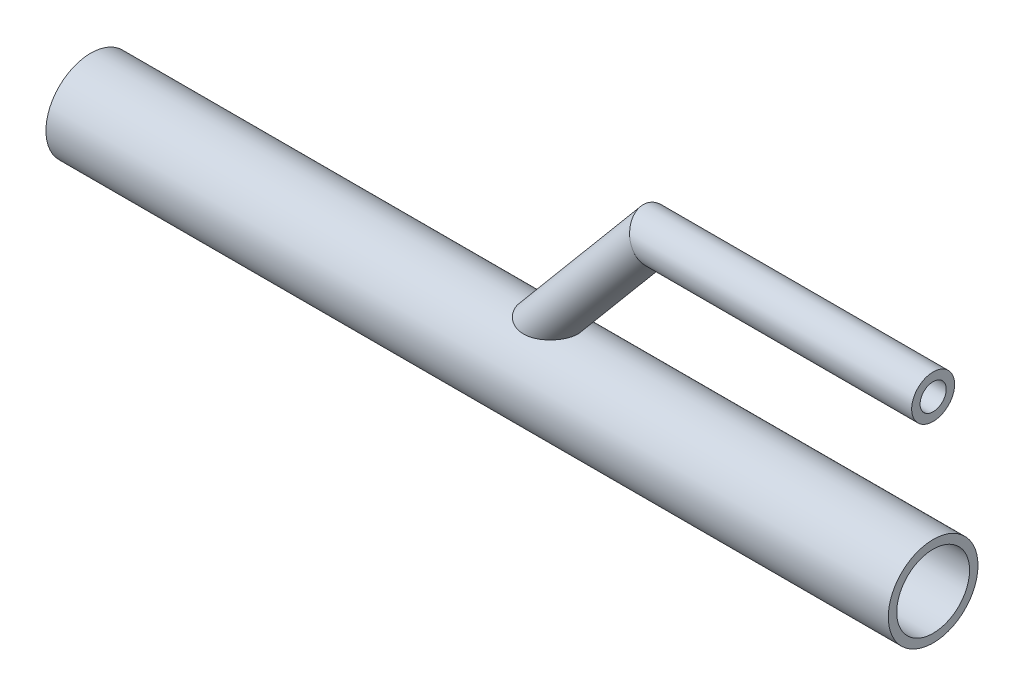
ISO-10303-21;
HEADER;
FILE_DESCRIPTION(('STEP AP214'),'2;1');
FILE_NAME('part.step','',(''),(''),'','','');
FILE_SCHEMA(('AUTOMOTIVE_DESIGN { 1 0 10303 214 1 1 1 1 }'));
ENDSEC;
DATA;
#1=APPLICATION_CONTEXT('core data for automotive mechanical design processes');
#2=APPLICATION_PROTOCOL_DEFINITION('international standard','automotive_design',2000,#1);
#3=PRODUCT_CONTEXT('',#1,'mechanical');
#4=PRODUCT('Part','Part','',(#3));
#5=PRODUCT_RELATED_PRODUCT_CATEGORY('part','',(#4));
#6=PRODUCT_DEFINITION_FORMATION('','',#4);
#7=PRODUCT_DEFINITION_CONTEXT('part definition',#1,'design');
#8=PRODUCT_DEFINITION('design','',#6,#7);
#9=PRODUCT_DEFINITION_SHAPE('','',#8);
#10=(LENGTH_UNIT() NAMED_UNIT(*) SI_UNIT(.MILLI.,.METRE.));
#11=(NAMED_UNIT(*) PLANE_ANGLE_UNIT() SI_UNIT($,.RADIAN.));
#12=(NAMED_UNIT(*) SI_UNIT($,.STERADIAN.) SOLID_ANGLE_UNIT());
#13=UNCERTAINTY_MEASURE_WITH_UNIT(LENGTH_MEASURE(1.E-05),#10,'distance_accuracy_value','');
#14=(GEOMETRIC_REPRESENTATION_CONTEXT(3) GLOBAL_UNCERTAINTY_ASSIGNED_CONTEXT((#13)) GLOBAL_UNIT_ASSIGNED_CONTEXT((#10,
#11,#12)) REPRESENTATION_CONTEXT('',''));
#15=CARTESIAN_POINT('',(0.,0.,0.));
#16=DIRECTION('',(0.,0.,1.));
#17=DIRECTION('',(1.,0.,0.));
#18=AXIS2_PLACEMENT_3D('',#15,#16,#17);
#19=CARTESIAN_POINT('',(133.563985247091,40.0000000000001,0.));
#20=DIRECTION('',(-0.642787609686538,-0.766044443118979,0.));
#21=DIRECTION('',(0.766044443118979,-0.642787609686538,0.));
#22=AXIS2_PLACEMENT_3D('',#19,#20,#21);
#23=CYLINDRICAL_SURFACE('',#22,3.09999999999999);
#24=CARTESIAN_POINT('',(133.563985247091,40.0000000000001,0.));
#25=DIRECTION('',(0.90630778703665,0.4226182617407,0.));
#26=DIRECTION('',(0.4226182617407,-0.90630778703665,0.));
#27=AXIS2_PLACEMENT_3D('',#24,#25,#26);
#28=ELLIPSE('',#27,3.42047154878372,3.09999999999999);
#29=CARTESIAN_POINT('',(135.009538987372,36.9000000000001,0.));
#30=VERTEX_POINT('',#29);
#31=EDGE_CURVE('E67',#30,#30,#28,.T.);
#32=ORIENTED_EDGE('',*,*,#31,.T.);
#33=EDGE_LOOP('',(#32));
#34=FACE_BOUND('',#33,.T.);
#35=CARTESIAN_POINT('',(112.983173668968,10.65,0.));
#36=CARTESIAN_POINT('',(112.983173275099,10.6499998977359,0.065892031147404));
#37=CARTESIAN_POINT('',(112.979909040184,10.6493862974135,0.131793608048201));
#38=CARTESIAN_POINT('',(112.966946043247,10.6469552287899,0.262969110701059));
#39=CARTESIAN_POINT('',(112.957243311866,10.6451370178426,0.328242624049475));
#40=CARTESIAN_POINT('',(112.93164980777,10.6403596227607,0.457653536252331));
#41=CARTESIAN_POINT('',(112.915746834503,10.6373981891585,0.521788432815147));
#42=CARTESIAN_POINT('',(112.878173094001,10.6304388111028,0.648301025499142));
#43=CARTESIAN_POINT('',(112.856499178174,10.626440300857,0.710677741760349));
#44=CARTESIAN_POINT('',(112.784092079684,10.6131727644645,0.893195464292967));
#45=CARTESIAN_POINT('',(112.725653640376,10.6025706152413,1.01024498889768));
#46=CARTESIAN_POINT('',(112.592355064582,10.5788659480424,1.23402442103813));
#47=CARTESIAN_POINT('',(112.517491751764,10.565762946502,1.34075232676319));
#48=CARTESIAN_POINT('',(112.310212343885,10.5303863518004,1.59960426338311));
#49=CARTESIAN_POINT('',(112.168802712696,10.5070356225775,1.74436936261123));
#50=CARTESIAN_POINT('',(111.865101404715,10.4594758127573,2.01001455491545));
#51=CARTESIAN_POINT('',(111.702751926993,10.4352644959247,2.13082609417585));
#52=CARTESIAN_POINT('',(111.410937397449,10.3946361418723,2.31959657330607));
#53=CARTESIAN_POINT('',(111.284904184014,10.377926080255,2.39290505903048));
#54=CARTESIAN_POINT('',(111.026841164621,10.3457215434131,2.5285204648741));
#55=CARTESIAN_POINT('',(110.894808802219,10.3302275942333,2.59082263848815));
#56=CARTESIAN_POINT('',(110.62591994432,10.3009735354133,2.70479252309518));
#57=CARTESIAN_POINT('',(110.489059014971,10.2872150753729,2.75645014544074));
#58=CARTESIAN_POINT('',(110.211628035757,10.2619156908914,2.84919207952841));
#59=CARTESIAN_POINT('',(110.071058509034,10.2503744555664,2.89027787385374));
#60=CARTESIAN_POINT('',(109.783870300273,10.2297065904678,2.96260868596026));
#61=CARTESIAN_POINT('',(109.63718663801,10.2206397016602,2.99361320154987));
#62=CARTESIAN_POINT('',(109.341676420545,10.2056886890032,3.04419339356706));
#63=CARTESIAN_POINT('',(109.192849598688,10.1998049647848,3.06376763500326));
#64=CARTESIAN_POINT('',(108.894189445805,10.1916073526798,3.09093005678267));
#65=CARTESIAN_POINT('',(108.744357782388,10.1892885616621,3.09853470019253));
#66=CARTESIAN_POINT('',(108.444634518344,10.1885119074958,3.10108206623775));
#67=CARTESIAN_POINT('',(108.294742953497,10.1900527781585,3.09602894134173));
#68=CARTESIAN_POINT('',(107.919719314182,10.1990516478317,3.06631998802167));
#69=CARTESIAN_POINT('',(107.695236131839,10.2091285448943,3.03297463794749));
#70=CARTESIAN_POINT('',(107.254873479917,10.238605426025,2.93193737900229));
#71=CARTESIAN_POINT('',(107.038982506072,10.2579924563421,2.8642931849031));
#72=CARTESIAN_POINT('',(106.657876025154,10.3007316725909,2.70608521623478));
#73=CARTESIAN_POINT('',(106.490204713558,10.322887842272,2.62120567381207));
#74=CARTESIAN_POINT('',(106.251341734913,10.3587410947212,2.4741669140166));
#75=CARTESIAN_POINT('',(106.173797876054,10.3711344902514,2.42184104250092));
#76=CARTESIAN_POINT('',(106.023626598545,10.3964631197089,2.31069416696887));
#77=CARTESIAN_POINT('',(105.950997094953,10.4093981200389,2.25187594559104));
#78=CARTESIAN_POINT('',(105.810912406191,10.4355244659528,2.1275306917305));
#79=CARTESIAN_POINT('',(105.743493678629,10.4487169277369,2.06196277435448));
#80=CARTESIAN_POINT('',(105.615092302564,10.4748504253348,1.92480649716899));
#81=CARTESIAN_POINT('',(105.55410664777,10.487791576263,1.85322097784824));
#82=CARTESIAN_POINT('',(105.439196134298,10.512991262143,1.70446368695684));
#83=CARTESIAN_POINT('',(105.385271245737,10.5252497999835,1.62729193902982));
#84=CARTESIAN_POINT('',(105.285087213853,10.5486475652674,1.46800285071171));
#85=CARTESIAN_POINT('',(105.238827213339,10.5597869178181,1.38588606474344));
#86=CARTESIAN_POINT('',(105.121351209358,10.5886816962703,1.15116160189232));
#87=CARTESIAN_POINT('',(105.059010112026,10.6047757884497,0.99377051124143));
#88=CARTESIAN_POINT('',(104.962582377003,10.6301334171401,0.670149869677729));
#89=CARTESIAN_POINT('',(104.928485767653,10.6393993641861,0.503923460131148));
#90=CARTESIAN_POINT('',(104.890600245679,10.6497234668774,0.176758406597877));
#91=CARTESIAN_POINT('',(104.885299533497,10.6511909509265,0.0160070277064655));
#92=CARTESIAN_POINT('',(104.901103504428,10.646861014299,-0.304073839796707));
#93=CARTESIAN_POINT('',(104.9222042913,10.6410646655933,-0.463403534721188));
#94=CARTESIAN_POINT('',(104.98982251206,10.6229396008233,-0.774386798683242));
#95=CARTESIAN_POINT('',(105.036066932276,10.6106810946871,-0.926104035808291));
#96=CARTESIAN_POINT('',(105.152423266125,10.580975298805,-1.21951925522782));
#97=CARTESIAN_POINT('',(105.222534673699,10.5635281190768,-1.36121744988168));
#98=CARTESIAN_POINT('',(105.385798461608,10.5249407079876,-1.63319203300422));
#99=CARTESIAN_POINT('',(105.479299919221,10.5037460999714,-1.76325064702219));
#100=CARTESIAN_POINT('',(105.685798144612,10.4600039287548,-2.00652186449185));
#101=CARTESIAN_POINT('',(105.798797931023,10.4374561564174,-2.11973185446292));
#102=CARTESIAN_POINT('',(106.047499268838,10.3918729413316,-2.33325447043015));
#103=CARTESIAN_POINT('',(106.184107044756,10.368878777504,-2.43251663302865));
#104=CARTESIAN_POINT('',(106.470921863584,10.3257376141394,-2.60959130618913));
#105=CARTESIAN_POINT('',(106.621133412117,10.3055915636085,-2.68739667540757));
#106=CARTESIAN_POINT('',(106.949646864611,10.2674198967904,-2.82996464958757));
#107=CARTESIAN_POINT('',(107.129161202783,10.249934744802,-2.89206038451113));
#108=CARTESIAN_POINT('',(107.495447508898,10.2213714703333,-2.9914438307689));
#109=CARTESIAN_POINT('',(107.682225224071,10.2102985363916,-3.02871145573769));
#110=CARTESIAN_POINT('',(108.01022515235,10.1968198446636,-3.07371428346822));
#111=CARTESIAN_POINT('',(108.150722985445,10.1929124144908,-3.08659723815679));
#112=CARTESIAN_POINT('',(108.43240775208,10.1886499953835,-3.10064073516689));
#113=CARTESIAN_POINT('',(108.573594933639,10.1882963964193,-3.10179669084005));
#114=CARTESIAN_POINT('',(108.855815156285,10.1909477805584,-3.09307269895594));
#115=CARTESIAN_POINT('',(108.996847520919,10.1939585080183,-3.08317387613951));
#116=CARTESIAN_POINT('',(109.277653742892,10.2030697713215,-3.05288653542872));
#117=CARTESIAN_POINT('',(109.417427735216,10.2091699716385,-3.03249915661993));
#118=CARTESIAN_POINT('',(109.696963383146,10.2242449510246,-2.98128124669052));
#119=CARTESIAN_POINT('',(109.836696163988,10.2332596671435,-2.95030526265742));
#120=CARTESIAN_POINT('',(110.113353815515,10.2537661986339,-2.87822552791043));
#121=CARTESIAN_POINT('',(110.250278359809,10.2652583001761,-2.83712060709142));
#122=CARTESIAN_POINT('',(110.520412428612,10.2903103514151,-2.74486805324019));
#123=CARTESIAN_POINT('',(110.653624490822,10.3038688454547,-2.69372748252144));
#124=CARTESIAN_POINT('',(110.915444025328,10.3326155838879,-2.58126165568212));
#125=CARTESIAN_POINT('',(111.044052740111,10.3478033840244,-2.51993917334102));
#126=CARTESIAN_POINT('',(111.359926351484,10.3873977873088,-2.35271024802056));
#127=CARTESIAN_POINT('',(111.543591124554,10.4125501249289,-2.24003175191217));
#128=CARTESIAN_POINT('',(111.892182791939,10.4634471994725,-1.98876662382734));
#129=CARTESIAN_POINT('',(112.057140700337,10.4891908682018,-1.85022391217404));
#130=CARTESIAN_POINT('',(112.313977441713,10.5310839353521,-1.59073923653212));
#131=CARTESIAN_POINT('',(112.412949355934,10.5477982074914,-1.47694639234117));
#132=CARTESIAN_POINT('',(112.592451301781,10.578823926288,-1.23521831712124));
#133=CARTESIAN_POINT('',(112.673004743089,10.5931384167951,-1.10730134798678));
#134=CARTESIAN_POINT('',(112.795357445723,10.6152121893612,-0.866694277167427));
#135=CARTESIAN_POINT('',(112.841738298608,10.6237163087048,-0.756413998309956));
#136=CARTESIAN_POINT('',(112.915956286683,10.6374210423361,-0.529680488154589));
#137=CARTESIAN_POINT('',(112.943840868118,10.6426301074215,-0.413243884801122));
#138=CARTESIAN_POINT('',(112.968577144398,10.6472608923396,-0.246479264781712));
#139=CARTESIAN_POINT('',(112.97403937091,10.6482853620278,-0.197364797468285));
#140=CARTESIAN_POINT('',(112.981338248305,10.6496550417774,-0.0988353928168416));
#141=CARTESIAN_POINT('',(112.983173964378,10.6500000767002,-0.0494203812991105));
#142=CARTESIAN_POINT('',(112.983173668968,10.65,0.));
#143=B_SPLINE_CURVE_WITH_KNOTS('',3,(#35,#36,#37,#38,#39,#40,#41,#42,#43,#44,#45,#46,#47,#48,
#49,#50,#51,#52,#53,#54,#55,#56,#57,#58,#59,#60,#61,#62,#63,#64,#65,#66,#67,#68,#69,#70,#71,#72,
#73,#74,#75,#76,#77,#78,#79,#80,#81,#82,#83,#84,#85,#86,#87,#88,#89,#90,#91,#92,#93,#94,#95,#96,
#97,#98,#99,#100,#101,#102,#103,#104,#105,#106,#107,#108,#109,#110,#111,#112,#113,#114,#115,
#116,#117,#118,#119,#120,#121,#122,#123,#124,#125,#126,#127,#128,#129,#130,#131,#132,#133,#134,
#135,#136,#137,#138,#139,#140,#141,#142),.UNSPECIFIED.,.T.,.F.,(4,2,2,2,2,2,2,2,2,2,2,2,2,2,2,2,
2,2,2,2,2,2,2,2,2,2,2,2,2,2,2,2,2,2,2,2,2,2,2,2,2,2,2,2,2,2,2,2,2,2,2,2,2,4),(0.,
0.197609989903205,0.395341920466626,0.593464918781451,0.791696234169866,1.183558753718,
1.57549712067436,2.18322788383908,2.7926736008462,3.2324102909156,3.67233615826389,
4.11267707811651,4.55295621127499,5.00307699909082,5.45325428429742,5.90281184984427,
6.35222195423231,7.03103219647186,7.70890069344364,8.27401042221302,8.55680522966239,
8.83947929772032,9.12397946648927,9.40834608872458,9.69271150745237,9.97704510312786,
10.4843346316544,10.9914449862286,11.4716543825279,11.9517929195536,12.4268192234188,
12.9018354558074,13.3844147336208,13.8670687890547,14.3762430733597,14.8855866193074,
15.4557513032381,16.0263767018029,16.4492768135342,16.872342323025,17.2961312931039,
17.7198742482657,18.1496889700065,18.5795533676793,19.0091163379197,19.438562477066,
20.0874024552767,20.7351504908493,21.1889650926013,21.6421996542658,22.0006525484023,
22.3581823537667,22.506355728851,22.6545672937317),.UNSPECIFIED.);
#144=CARTESIAN_POINT('',(112.983173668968,10.65,0.));
#145=VERTEX_POINT('',#144);
#146=EDGE_CURVE('E72',#145,#145,#143,.T.);
#147=ORIENTED_EDGE('',*,*,#146,.T.);
#148=EDGE_LOOP('',(#147));
#149=FACE_BOUND('',#148,.T.);
#150=ADVANCED_FACE('F56',(#34,#149),#23,.F.);
#151=CARTESIAN_POINT('',(133.563985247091,40.0000000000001,0.));
#152=DIRECTION('',(-0.642787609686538,-0.766044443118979,0.));
#153=DIRECTION('',(0.766044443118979,-0.642787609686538,0.));
#154=AXIS2_PLACEMENT_3D('',#151,#152,#153);
#155=CYLINDRICAL_SURFACE('',#154,5.1);
#156=CARTESIAN_POINT('',(133.563985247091,40.0000000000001,0.));
#157=DIRECTION('',(0.90630778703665,0.4226182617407,0.));
#158=DIRECTION('',(0.4226182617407,-0.90630778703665,0.));
#159=AXIS2_PLACEMENT_3D('',#156,#157,#158);
#160=ELLIPSE('',#159,5.62722738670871,5.1);
#161=CARTESIAN_POINT('',(135.942154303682,34.9000000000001,0.));
#162=VERTEX_POINT('',#161);
#163=EDGE_CURVE('E12',#162,#162,#160,.T.);
#164=ORIENTED_EDGE('',*,*,#163,.F.);
#165=EDGE_LOOP('',(#164));
#166=FACE_BOUND('',#165,.T.);
#167=CARTESIAN_POINT('',(115.593988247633,10.65,0.));
#168=CARTESIAN_POINT('',(115.593990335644,10.6500006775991,0.0860487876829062));
#169=CARTESIAN_POINT('',(115.590260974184,10.6489540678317,0.172081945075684));
#170=CARTESIAN_POINT('',(115.575460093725,10.6448056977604,0.343471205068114));
#171=CARTESIAN_POINT('',(115.564386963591,10.6417034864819,0.428827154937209));
#172=CARTESIAN_POINT('',(115.520478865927,10.6294235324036,0.683043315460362));
#173=CARTESIAN_POINT('',(115.476955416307,10.6172725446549,0.850001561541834));
#174=CARTESIAN_POINT('',(115.352396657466,10.5827492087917,1.2116752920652));
#175=CARTESIAN_POINT('',(115.265059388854,10.5586749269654,1.40400788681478));
#176=CARTESIAN_POINT('',(115.061434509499,10.5032767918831,1.77155353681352));
#177=CARTESIAN_POINT('',(114.945094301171,10.47193977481,1.94673467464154));
#178=CARTESIAN_POINT('',(114.721470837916,10.4126968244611,2.23938761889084));
#179=CARTESIAN_POINT('',(114.618723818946,10.3857746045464,2.36061431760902));
#180=CARTESIAN_POINT('',(114.403174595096,10.330107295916,2.59339790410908));
#181=CARTESIAN_POINT('',(114.290367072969,10.301361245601,2.70494961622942));
#182=CARTESIAN_POINT('',(114.05649245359,10.2427557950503,2.91903963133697));
#183=CARTESIAN_POINT('',(113.935412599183,10.2128947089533,3.02156342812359));
#184=CARTESIAN_POINT('',(113.686572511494,10.1526992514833,3.21803452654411));
#185=CARTESIAN_POINT('',(113.558810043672,10.1223647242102,3.3119789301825));
#186=CARTESIAN_POINT('',(113.216805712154,10.042946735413,3.54759232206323));
#187=CARTESIAN_POINT('',(112.998050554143,9.99389743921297,3.68274593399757));
#188=CARTESIAN_POINT('',(112.549338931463,9.89773995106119,3.93386499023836));
#189=CARTESIAN_POINT('',(112.319375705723,9.85063296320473,4.04981866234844));
#190=CARTESIAN_POINT('',(111.849994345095,9.75985840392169,4.26394272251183));
#191=CARTESIAN_POINT('',(111.610554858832,9.71619935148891,4.36206979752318));
#192=CARTESIAN_POINT('',(111.124426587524,9.63399223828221,4.54074354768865));
#193=CARTESIAN_POINT('',(110.877739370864,9.5954430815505,4.62129399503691));
#194=CARTESIAN_POINT('',(110.367897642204,9.52353763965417,4.76777344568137));
#195=CARTESIAN_POINT('',(110.104485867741,9.49046586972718,4.83295028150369));
#196=CARTESIAN_POINT('',(109.572411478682,9.43343909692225,4.94333842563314));
#197=CARTESIAN_POINT('',(109.303747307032,9.40948684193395,4.98854371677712));
#198=CARTESIAN_POINT('',(108.763844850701,9.372798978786,5.0571389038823));
#199=CARTESIAN_POINT('',(108.492619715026,9.36002232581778,5.08060864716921));
#200=CARTESIAN_POINT('',(107.948902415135,9.34759116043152,5.1034572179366));
#201=CARTESIAN_POINT('',(107.676411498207,9.34792569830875,5.10285614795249));
#202=CARTESIAN_POINT('',(107.24433379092,9.36028240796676,5.08012319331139));
#203=CARTESIAN_POINT('',(107.08410945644,9.36747298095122,5.06688948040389));
#204=CARTESIAN_POINT('',(106.765211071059,9.38729476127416,5.0300747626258));
#205=CARTESIAN_POINT('',(106.6065365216,9.39992415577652,5.00649720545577));
#206=CARTESIAN_POINT('',(106.291857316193,9.43072512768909,4.94823270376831));
#207=CARTESIAN_POINT('',(106.135851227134,9.44889362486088,4.91355193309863));
#208=CARTESIAN_POINT('',(105.827665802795,9.49067608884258,4.83235485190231));
#209=CARTESIAN_POINT('',(105.675486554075,9.51429017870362,4.78583827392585));
#210=CARTESIAN_POINT('',(105.374939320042,9.56685336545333,4.67988733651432));
#211=CARTESIAN_POINT('',(105.226621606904,9.59585125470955,4.62033386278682));
#212=CARTESIAN_POINT('',(104.936867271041,9.65835174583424,4.4882152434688));
#213=CARTESIAN_POINT('',(104.795430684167,9.6918543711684,4.41565003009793));
#214=CARTESIAN_POINT('',(104.521019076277,9.76236576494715,4.25748774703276));
#215=CARTESIAN_POINT('',(104.388041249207,9.79937336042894,4.17189503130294));
#216=CARTESIAN_POINT('',(104.131922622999,9.87565586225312,3.98795944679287));
#217=CARTESIAN_POINT('',(104.008780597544,9.91493048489,3.88961817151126));
#218=CARTESIAN_POINT('',(103.788657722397,9.98922185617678,3.69424140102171));
#219=CARTESIAN_POINT('',(103.690347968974,10.0241378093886,3.59865956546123));
#220=CARTESIAN_POINT('',(103.502762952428,10.0936223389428,3.39889190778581));
#221=CARTESIAN_POINT('',(103.413487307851,10.1281909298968,3.29470644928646));
#222=CARTESIAN_POINT('',(103.244484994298,10.1959979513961,3.07846751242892));
#223=CARTESIAN_POINT('',(103.164757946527,10.2292364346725,2.96641434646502));
#224=CARTESIAN_POINT('',(103.01522239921,10.2934550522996,2.73526383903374));
#225=CARTESIAN_POINT('',(102.945413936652,10.3244351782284,2.6161664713));
#226=CARTESIAN_POINT('',(102.818479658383,10.3821542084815,2.37654615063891));
#227=CARTESIAN_POINT('',(102.760968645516,10.4090105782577,2.25625517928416));
#228=CARTESIAN_POINT('',(102.655502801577,10.4592010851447,2.01079789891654));
#229=CARTESIAN_POINT('',(102.607551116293,10.4825340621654,1.88563000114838));
#230=CARTESIAN_POINT('',(102.521350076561,10.525099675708,1.63137507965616));
#231=CARTESIAN_POINT('',(102.483097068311,10.5443338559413,1.5022895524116));
#232=CARTESIAN_POINT('',(102.4163231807,10.5782702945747,1.24099204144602));
#233=CARTESIAN_POINT('',(102.387805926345,10.592970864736,1.10877891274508));
#234=CARTESIAN_POINT('',(102.340090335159,10.6177387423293,0.839503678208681));
#235=CARTESIAN_POINT('',(102.321089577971,10.6277076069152,0.702397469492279));
#236=CARTESIAN_POINT('',(102.293292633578,10.6423383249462,0.426826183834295));
#237=CARTESIAN_POINT('',(102.284500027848,10.6469983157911,0.288360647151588));
#238=CARTESIAN_POINT('',(102.277140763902,10.6508966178,0.011091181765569));
#239=CARTESIAN_POINT('',(102.278573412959,10.6501352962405,-0.127712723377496));
#240=CARTESIAN_POINT('',(102.29166154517,10.6432095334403,-0.40470249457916));
#241=CARTESIAN_POINT('',(102.303317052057,10.637045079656,-0.542888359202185));
#242=CARTESIAN_POINT('',(102.337014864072,10.619363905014,-0.81912454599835));
#243=CARTESIAN_POINT('',(102.359165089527,10.6077915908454,-0.957158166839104));
#244=CARTESIAN_POINT('',(102.413853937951,10.5795592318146,-1.23057241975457));
#245=CARTESIAN_POINT('',(102.446388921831,10.5629009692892,-1.36595396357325));
#246=CARTESIAN_POINT('',(102.521812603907,10.5248957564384,-1.63318412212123));
#247=CARTESIAN_POINT('',(102.564705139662,10.5035470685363,-1.76503140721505));
#248=CARTESIAN_POINT('',(102.66073350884,10.4567083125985,-2.02412342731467));
#249=CARTESIAN_POINT('',(102.713865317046,10.4312198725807,-2.15136994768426));
#250=CARTESIAN_POINT('',(102.829912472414,10.3769075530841,-2.39965560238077));
#251=CARTESIAN_POINT('',(102.892769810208,10.348103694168,-2.52072622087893));
#252=CARTESIAN_POINT('',(103.028258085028,10.2878084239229,-2.7565013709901));
#253=CARTESIAN_POINT('',(103.100885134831,10.2563180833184,-2.87120840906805));
#254=CARTESIAN_POINT('',(103.255631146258,10.1914874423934,-3.0934583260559));
#255=CARTESIAN_POINT('',(103.337749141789,10.1581473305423,-3.20100193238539));
#256=CARTESIAN_POINT('',(103.511076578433,10.0905263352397,-3.40817462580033));
#257=CARTESIAN_POINT('',(103.602285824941,10.0562454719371,-3.50780388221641));
#258=CARTESIAN_POINT('',(103.791281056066,9.98839854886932,-3.69651775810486));
#259=CARTESIAN_POINT('',(103.888891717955,9.95483238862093,-3.78577802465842));
#260=CARTESIAN_POINT('',(104.091686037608,9.8885842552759,-3.95559239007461));
#261=CARTESIAN_POINT('',(104.196869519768,9.85590226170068,-4.03614669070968));
#262=CARTESIAN_POINT('',(104.414028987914,9.79225993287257,-4.18819050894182));
#263=CARTESIAN_POINT('',(104.526002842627,9.76129906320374,-4.25968284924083));
#264=CARTESIAN_POINT('',(104.755969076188,9.7018100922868,-4.39348893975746));
#265=CARTESIAN_POINT('',(104.873963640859,9.6732828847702,-4.45579932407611));
#266=CARTESIAN_POINT('',(105.11592718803,9.61908172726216,-4.57164040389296));
#267=CARTESIAN_POINT('',(105.239933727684,9.59343030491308,-4.6251031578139));
#268=CARTESIAN_POINT('',(105.492185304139,9.54567566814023,-4.72287109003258));
#269=CARTESIAN_POINT('',(105.620431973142,9.52357383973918,-4.76717269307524));
#270=CARTESIAN_POINT('',(106.010164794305,9.46310764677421,-4.88674475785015));
#271=CARTESIAN_POINT('',(106.276761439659,9.43055589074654,-4.94873751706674));
#272=CARTESIAN_POINT('',(106.743824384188,9.38832703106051,-5.02823295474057));
#273=CARTESIAN_POINT('',(106.942793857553,9.37485249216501,-5.05321684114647));
#274=CARTESIAN_POINT('',(107.342544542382,9.35622296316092,-5.08763185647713));
#275=CARTESIAN_POINT('',(107.543326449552,9.3510713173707,-5.09705673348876));
#276=CARTESIAN_POINT('',(107.945557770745,9.34849886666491,-5.10177039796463));
#277=CARTESIAN_POINT('',(108.147007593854,9.35109753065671,-5.09702358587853));
#278=CARTESIAN_POINT('',(108.548932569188,9.3632897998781,-5.07458920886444));
#279=CARTESIAN_POINT('',(108.749407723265,9.37288339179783,-5.05690166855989));
#280=CARTESIAN_POINT('',(109.2270329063,9.40323326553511,-5.00031326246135));
#281=CARTESIAN_POINT('',(109.50334161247,9.4268952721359,-4.95580635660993));
#282=CARTESIAN_POINT('',(110.050724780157,9.48401754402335,-4.84559030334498));
#283=CARTESIAN_POINT('',(110.321796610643,9.51748260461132,-4.77987077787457));
#284=CARTESIAN_POINT('',(110.857261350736,9.59216800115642,-4.62817119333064));
#285=CARTESIAN_POINT('',(111.12165053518,9.63339255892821,-4.54218009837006));
#286=CARTESIAN_POINT('',(111.641930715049,9.72164273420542,-4.35009794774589));
#287=CARTESIAN_POINT('',(111.897825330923,9.76866583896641,-4.24401558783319));
#288=CARTESIAN_POINT('',(112.329458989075,9.85301330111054,-4.04338188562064));
#289=CARTESIAN_POINT('',(112.507711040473,9.88940144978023,-3.95381856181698));
#290=CARTESIAN_POINT('',(112.857750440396,9.96348950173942,-3.76322237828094));
#291=CARTESIAN_POINT('',(113.029537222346,10.0011895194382,-3.66218851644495));
#292=CARTESIAN_POINT('',(113.364816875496,10.07699472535,-3.44812212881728));
#293=CARTESIAN_POINT('',(113.528328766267,10.1150987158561,-3.33511915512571));
#294=CARTESIAN_POINT('',(113.845467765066,10.1908388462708,-3.09596938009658));
#295=CARTESIAN_POINT('',(113.999100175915,10.2284752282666,-2.96982972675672));
#296=CARTESIAN_POINT('',(114.324197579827,10.3097356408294,-2.67576318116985));
#297=CARTESIAN_POINT('',(114.492852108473,10.3530034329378,-2.50457307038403));
#298=CARTESIAN_POINT('',(114.805036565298,10.4345747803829,-2.13941143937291));
#299=CARTESIAN_POINT('',(114.948592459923,10.4728834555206,-1.94546381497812));
#300=CARTESIAN_POINT('',(115.172654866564,10.5334378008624,-1.57968438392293));
#301=CARTESIAN_POINT('',(115.260083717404,10.5573620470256,-1.41246022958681));
#302=CARTESIAN_POINT('',(115.37065194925,10.5878199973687,-1.15247113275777));
#303=CARTESIAN_POINT('',(115.404064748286,10.5970639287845,-1.0643390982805));
#304=CARTESIAN_POINT('',(115.463351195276,10.6135111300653,-0.88540593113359));
#305=CARTESIAN_POINT('',(115.489227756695,10.6207151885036,-0.794605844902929));
#306=CARTESIAN_POINT('',(115.538232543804,10.6343830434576,-0.587900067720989));
#307=CARTESIAN_POINT('',(115.559055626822,10.6402113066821,-0.471393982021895));
#308=CARTESIAN_POINT('',(115.586932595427,10.6480194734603,-0.236582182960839));
#309=CARTESIAN_POINT('',(115.593985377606,10.6499990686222,-0.11827632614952));
#310=CARTESIAN_POINT('',(115.593988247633,10.65,0.));
#311=B_SPLINE_CURVE_WITH_KNOTS('',3,(#167,#168,#169,#170,#171,#172,#173,#174,#175,#176,#177,
#178,#179,#180,#181,#182,#183,#184,#185,#186,#187,#188,#189,#190,#191,#192,#193,#194,#195,#196,
#197,#198,#199,#200,#201,#202,#203,#204,#205,#206,#207,#208,#209,#210,#211,#212,#213,#214,#215,
#216,#217,#218,#219,#220,#221,#222,#223,#224,#225,#226,#227,#228,#229,#230,#231,#232,#233,#234,
#235,#236,#237,#238,#239,#240,#241,#242,#243,#244,#245,#246,#247,#248,#249,#250,#251,#252,#253,
#254,#255,#256,#257,#258,#259,#260,#261,#262,#263,#264,#265,#266,#267,#268,#269,#270,#271,#272,
#273,#274,#275,#276,#277,#278,#279,#280,#281,#282,#283,#284,#285,#286,#287,#288,#289,#290,#291,
#292,#293,#294,#295,#296,#297,#298,#299,#300,#301,#302,#303,#304,#305,#306,#307,#308,#309,#310),
.UNSPECIFIED.,.T.,.F.,(4,2,2,2,2,2,2,2,2,2,2,2,2,2,2,2,2,2,2,2,2,2,2,2,2,2,2,2,2,2,2,2,2,2,2,2,
2,2,2,2,2,2,2,2,2,2,2,2,2,2,2,2,2,2,2,2,2,2,2,2,2,2,2,2,2,2,2,2,2,2,2,4),(0.,0.258026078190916,
0.516108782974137,1.03242289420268,1.66680144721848,2.30233893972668,2.78522919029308,
3.26837619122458,3.75228586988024,4.236358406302,5.02050233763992,5.80512529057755,
6.59162985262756,7.37796545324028,8.197179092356,9.01663938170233,9.83307723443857,
10.6488332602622,11.1312591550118,11.6135243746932,12.0955218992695,12.5775303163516,
13.0641415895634,13.550755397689,14.0372069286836,14.5235977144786,14.94753567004,
15.3714557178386,15.795358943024,16.2192637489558,16.6268256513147,17.0345214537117,
17.4420634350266,17.8497569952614,18.2655964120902,18.6815816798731,19.0975387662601,
19.5134968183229,19.933828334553,20.3540127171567,20.7743530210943,21.1945284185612,
21.6122879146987,22.0298816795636,22.4474329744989,22.8649753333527,23.2738704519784,
23.6827560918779,24.0915140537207,24.5004214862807,24.9123362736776,25.3244115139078,
26.1481681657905,26.7503908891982,27.3528555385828,27.9568348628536,28.5608130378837,
29.4022394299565,30.2440781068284,31.0863761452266,31.9283104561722,32.5362727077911,
33.144288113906,33.750835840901,34.3570552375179,35.0876802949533,35.8175449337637,
36.3858498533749,36.6696567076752,36.9533536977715,37.307988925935,37.6626525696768),.UNSPECIFIED.);
#312=CARTESIAN_POINT('',(115.593988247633,10.65,0.));
#313=VERTEX_POINT('',#312);
#314=EDGE_CURVE('E60',#313,#313,#311,.T.);
#315=ORIENTED_EDGE('',*,*,#314,.F.);
#316=EDGE_LOOP('',(#315));
#317=FACE_BOUND('',#316,.T.);
#318=ADVANCED_FACE('F87',(#166,#317),#155,.T.);
#319=CARTESIAN_POINT('',(133.563985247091,40.0000000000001,0.));
#320=DIRECTION('',(0.90630778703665,0.4226182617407,0.));
#321=DIRECTION('',(-0.4226182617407,0.90630778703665,0.));
#322=AXIS2_PLACEMENT_3D('',#319,#320,#321);
#323=PLANE('',#322);
#324=ORIENTED_EDGE('',*,*,#31,.F.);
#325=EDGE_LOOP('',(#324));
#326=FACE_BOUND('',#325,.T.);
#327=ORIENTED_EDGE('',*,*,#163,.T.);
#328=EDGE_LOOP('',(#327));
#329=FACE_BOUND('',#328,.T.);
#330=ADVANCED_FACE('F58',(#326,#329),#323,.T.);
#331=CARTESIAN_POINT('',(200.,0.,0.));
#332=DIRECTION('',(-1.,0.,0.));
#333=DIRECTION('',(0.,0.,1.));
#334=AXIS2_PLACEMENT_3D('',#331,#332,#333);
#335=CYLINDRICAL_SURFACE('',#334,10.65);
#336=ORIENTED_EDGE('',*,*,#146,.F.);
#337=EDGE_LOOP('',(#336));
#338=FACE_BOUND('',#337,.T.);
#339=ORIENTED_EDGE('',*,*,#314,.T.);
#340=EDGE_LOOP('',(#339));
#341=FACE_BOUND('',#340,.T.);
#342=ADVANCED_FACE('F79',(#338,#341),#335,.F.);
#343=CLOSED_SHELL('',(#150,#318,#330,#342));
#344=MANIFOLD_SOLID_BREP('B2',#343);
#345=CARTESIAN_POINT('',(200.,40.,0.));
#346=DIRECTION('',(-1.,0.,0.));
#347=DIRECTION('',(0.,-1.,0.));
#348=AXIS2_PLACEMENT_3D('',#345,#346,#347);
#349=CYLINDRICAL_SURFACE('',#348,3.09999999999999);
#350=CARTESIAN_POINT('',(200.,40.,0.));
#351=DIRECTION('',(1.,0.,0.));
#352=DIRECTION('',(0.,1.,0.));
#353=AXIS2_PLACEMENT_3D('',#350,#351,#352);
#354=CIRCLE('',#353,3.09999999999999);
#355=CARTESIAN_POINT('',(200.,43.1,0.));
#356=VERTEX_POINT('',#355);
#357=EDGE_CURVE('E167',#356,#356,#354,.T.);
#358=ORIENTED_EDGE('',*,*,#357,.T.);
#359=EDGE_LOOP('',(#358));
#360=FACE_BOUND('',#359,.T.);
#361=CARTESIAN_POINT('',(133.563985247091,40.0000000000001,0.));
#362=DIRECTION('',(-0.90630778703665,-0.4226182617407,0.));
#363=DIRECTION('',(-0.4226182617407,0.90630778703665,0.));
#364=AXIS2_PLACEMENT_3D('',#361,#362,#363);
#365=ELLIPSE('',#364,3.42047154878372,3.09999999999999);
#366=CARTESIAN_POINT('',(132.118431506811,43.1000000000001,0.));
#367=VERTEX_POINT('',#366);
#368=EDGE_CURVE('E157',#367,#367,#365,.T.);
#369=ORIENTED_EDGE('',*,*,#368,.T.);
#370=EDGE_LOOP('',(#369));
#371=FACE_BOUND('',#370,.T.);
#372=ADVANCED_FACE('F153',(#360,#371),#349,.F.);
#373=CARTESIAN_POINT('',(200.,40.,0.));
#374=DIRECTION('',(-1.,0.,0.));
#375=DIRECTION('',(0.,-1.,0.));
#376=AXIS2_PLACEMENT_3D('',#373,#374,#375);
#377=CYLINDRICAL_SURFACE('',#376,5.1);
#378=CARTESIAN_POINT('',(200.,40.,0.));
#379=DIRECTION('',(1.,0.,0.));
#380=DIRECTION('',(0.,1.,0.));
#381=AXIS2_PLACEMENT_3D('',#378,#379,#380);
#382=CIRCLE('',#381,5.1);
#383=CARTESIAN_POINT('',(200.,45.1,0.));
#384=VERTEX_POINT('',#383);
#385=EDGE_CURVE('E161',#384,#384,#382,.T.);
#386=ORIENTED_EDGE('',*,*,#385,.F.);
#387=EDGE_LOOP('',(#386));
#388=FACE_BOUND('',#387,.T.);
#389=CARTESIAN_POINT('',(133.563985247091,40.0000000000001,0.));
#390=DIRECTION('',(-0.90630778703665,-0.4226182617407,0.));
#391=DIRECTION('',(-0.4226182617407,0.90630778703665,0.));
#392=AXIS2_PLACEMENT_3D('',#389,#390,#391);
#393=ELLIPSE('',#392,5.62722738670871,5.1);
#394=CARTESIAN_POINT('',(131.185816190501,45.1000000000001,0.));
#395=VERTEX_POINT('',#394);
#396=EDGE_CURVE('E55',#395,#395,#393,.T.);
#397=ORIENTED_EDGE('',*,*,#396,.F.);
#398=EDGE_LOOP('',(#397));
#399=FACE_BOUND('',#398,.T.);
#400=ADVANCED_FACE('F180',(#388,#399),#377,.T.);
#401=CARTESIAN_POINT('',(200.,40.,0.));
#402=DIRECTION('',(1.,0.,0.));
#403=DIRECTION('',(0.,1.,0.));
#404=AXIS2_PLACEMENT_3D('',#401,#402,#403);
#405=PLANE('',#404);
#406=ORIENTED_EDGE('',*,*,#357,.F.);
#407=EDGE_LOOP('',(#406));
#408=FACE_BOUND('',#407,.T.);
#409=ORIENTED_EDGE('',*,*,#385,.T.);
#410=EDGE_LOOP('',(#409));
#411=FACE_BOUND('',#410,.T.);
#412=ADVANCED_FACE('F176',(#408,#411),#405,.T.);
#413=CARTESIAN_POINT('',(133.563985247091,40.0000000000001,0.));
#414=DIRECTION('',(-0.90630778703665,-0.4226182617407,0.));
#415=DIRECTION('',(0.4226182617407,-0.90630778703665,0.));
#416=AXIS2_PLACEMENT_3D('',#413,#414,#415);
#417=PLANE('',#416);
#418=ORIENTED_EDGE('',*,*,#368,.F.);
#419=EDGE_LOOP('',(#418));
#420=FACE_BOUND('',#419,.T.);
#421=ORIENTED_EDGE('',*,*,#396,.T.);
#422=EDGE_LOOP('',(#421));
#423=FACE_BOUND('',#422,.T.);
#424=ADVANCED_FACE('F155',(#420,#423),#417,.T.);
#425=CLOSED_SHELL('',(#372,#400,#412,#424));
#426=MANIFOLD_SOLID_BREP('B7',#425);
#427=CARTESIAN_POINT('',(200.,0.,0.));
#428=DIRECTION('',(-1.,0.,0.));
#429=DIRECTION('',(0.,0.,1.));
#430=AXIS2_PLACEMENT_3D('',#427,#428,#429);
#431=CYLINDRICAL_SURFACE('',#430,8.65);
#432=CARTESIAN_POINT('',(200.,0.,0.));
#433=DIRECTION('',(1.,0.,0.));
#434=DIRECTION('',(0.,0.,-1.));
#435=AXIS2_PLACEMENT_3D('',#432,#433,#434);
#436=CIRCLE('',#435,8.65);
#437=CARTESIAN_POINT('',(200.,0.,-8.65));
#438=VERTEX_POINT('',#437);
#439=EDGE_CURVE('E242',#438,#438,#436,.T.);
#440=ORIENTED_EDGE('',*,*,#439,.T.);
#441=EDGE_LOOP('',(#440));
#442=FACE_BOUND('',#441,.T.);
#443=CARTESIAN_POINT('',(0.,0.,0.));
#444=DIRECTION('',(1.,0.,0.));
#445=DIRECTION('',(0.,0.,-1.));
#446=AXIS2_PLACEMENT_3D('',#443,#444,#445);
#447=CIRCLE('',#446,8.65);
#448=CARTESIAN_POINT('',(0.,0.,-8.65));
#449=VERTEX_POINT('',#448);
#450=EDGE_CURVE('E248',#449,#449,#447,.T.);
#451=ORIENTED_EDGE('',*,*,#450,.F.);
#452=EDGE_LOOP('',(#451));
#453=FACE_BOUND('',#452,.T.);
#454=ADVANCED_FACE('F235',(#442,#453),#431,.F.);
#455=CARTESIAN_POINT('',(200.,0.,0.));
#456=DIRECTION('',(-1.,0.,0.));
#457=DIRECTION('',(0.,0.,1.));
#458=AXIS2_PLACEMENT_3D('',#455,#456,#457);
#459=CYLINDRICAL_SURFACE('',#458,10.65);
#460=CARTESIAN_POINT('',(200.,0.,0.));
#461=DIRECTION('',(1.,0.,0.));
#462=DIRECTION('',(0.,0.,-1.));
#463=AXIS2_PLACEMENT_3D('',#460,#461,#462);
#464=CIRCLE('',#463,10.65);
#465=CARTESIAN_POINT('',(200.,0.,-10.65));
#466=VERTEX_POINT('',#465);
#467=EDGE_CURVE('E152',#466,#466,#464,.T.);
#468=ORIENTED_EDGE('',*,*,#467,.F.);
#469=EDGE_LOOP('',(#468));
#470=FACE_BOUND('',#469,.T.);
#471=CARTESIAN_POINT('',(0.,0.,0.));
#472=DIRECTION('',(1.,0.,0.));
#473=DIRECTION('',(0.,0.,-1.));
#474=AXIS2_PLACEMENT_3D('',#471,#472,#473);
#475=CIRCLE('',#474,10.65);
#476=CARTESIAN_POINT('',(0.,0.,-10.65));
#477=VERTEX_POINT('',#476);
#478=EDGE_CURVE('E238',#477,#477,#475,.T.);
#479=ORIENTED_EDGE('',*,*,#478,.T.);
#480=EDGE_LOOP('',(#479));
#481=FACE_BOUND('',#480,.T.);
#482=ADVANCED_FACE('F255',(#470,#481),#459,.T.);
#483=CARTESIAN_POINT('',(200.,0.,0.));
#484=DIRECTION('',(1.,0.,0.));
#485=DIRECTION('',(0.,0.,-1.));
#486=AXIS2_PLACEMENT_3D('',#483,#484,#485);
#487=PLANE('',#486);
#488=ORIENTED_EDGE('',*,*,#439,.F.);
#489=EDGE_LOOP('',(#488));
#490=FACE_BOUND('',#489,.T.);
#491=ORIENTED_EDGE('',*,*,#467,.T.);
#492=EDGE_LOOP('',(#491));
#493=FACE_BOUND('',#492,.T.);
#494=ADVANCED_FACE('F259',(#490,#493),#487,.T.);
#495=CARTESIAN_POINT('',(0.,0.,0.));
#496=DIRECTION('',(1.,0.,0.));
#497=DIRECTION('',(0.,0.,-1.));
#498=AXIS2_PLACEMENT_3D('',#495,#496,#497);
#499=PLANE('',#498);
#500=ORIENTED_EDGE('',*,*,#450,.T.);
#501=EDGE_LOOP('',(#500));
#502=FACE_BOUND('',#501,.T.);
#503=ORIENTED_EDGE('',*,*,#478,.F.);
#504=EDGE_LOOP('',(#503));
#505=FACE_BOUND('',#504,.T.);
#506=ADVANCED_FACE('F257',(#502,#505),#499,.F.);
#507=CLOSED_SHELL('',(#454,#482,#494,#506));
#508=MANIFOLD_SOLID_BREP('B50',#507);
#509=ADVANCED_BREP_SHAPE_REPRESENTATION('',(#18,#344,#426,#508),#14);
#510=SHAPE_DEFINITION_REPRESENTATION(#9,#509);
ENDSEC;
END-ISO-10303-21;
